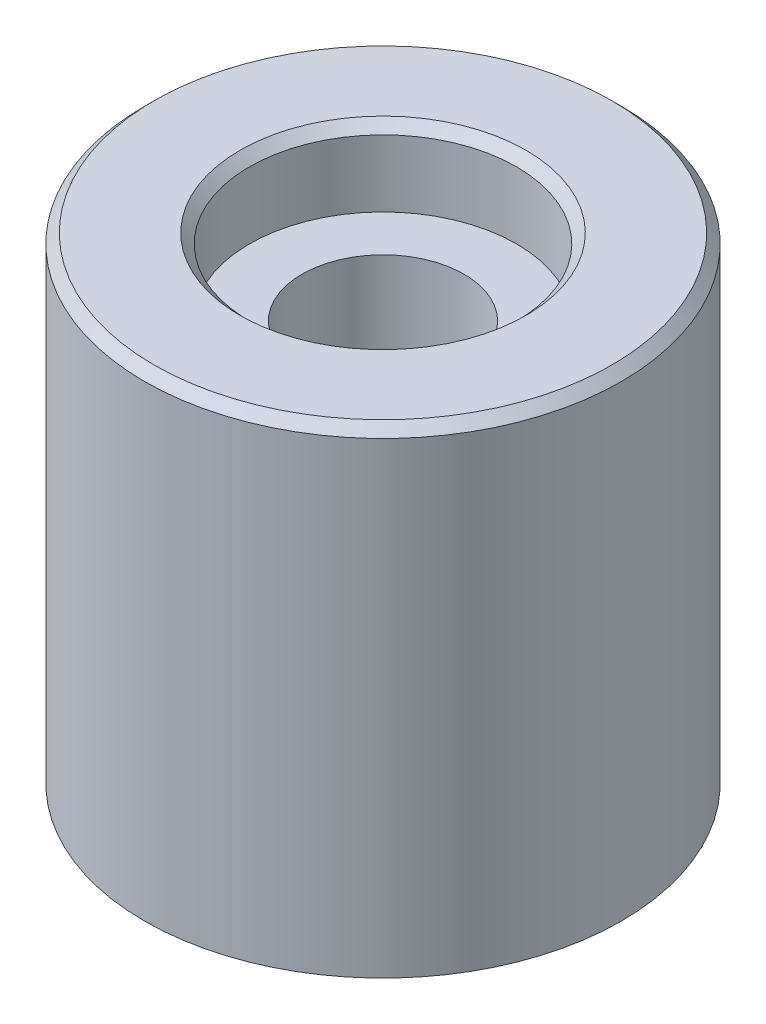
from build123d import *

# Parameters (mm, degrees)
CHANFREIN1_SIZE                               = 0.5
CHANFREIN2_SIZE                               = 0.5
TROU_POUR_TARAUDAGE_POUR_TROU_TARAUD_M1_D     = 8.5
TROU_POUR_TARAUDAGE_POUR_TROU_TARAUD_M1_DEPTH = 18
TROU_POUR_TARAUDAGE_POUR_TROU_TARAUD_M1_TIP   = 2.553657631


with BuildPart() as part:
    # Esquisse1 → R_volution1 (revolve)
    with BuildSketch(Plane.XY, mode=Mode.PRIVATE) as r_volution1_sk:
        Polygon((-7.5, 0), (-7.5, 2), (-12.5, 2), (-12.5, 27), (-7, 27), (-7, 23), (0, 23), (0, 0), align=None)
    revolve(r_volution1_sk.sketch.rotate(Axis((0, 0, 0), (0, 1, 0)), 270), axis=Axis((0, 0, 0), (0, 1, 0)))

    # Chanfrein1
    chanfrein1_edges = [part.edges().sort_by_distance(p)[0] for p in [
        (0, 0, 7.5),
    ]]
    chamfer(chanfrein1_edges, length=CHANFREIN1_SIZE)

    # Chanfrein2
    chanfrein2_edges = [part.edges().sort_by_distance(p)[0] for p in [
        (0, 27, 7),
        (0, 27, 12.5),
    ]]
    chamfer(chanfrein2_edges, length=CHANFREIN2_SIZE)

    # Trou pour taraudage pour trou taraud_ M1
    with Locations(Plane(origin=(0, 23, 0), x_dir=(1, 0, 0), z_dir=(0, 1, 0))):
        with Locations((0, 0)):
            Hole(TROU_POUR_TARAUDAGE_POUR_TROU_TARAUD_M1_D / 2, depth=TROU_POUR_TARAUDAGE_POUR_TROU_TARAUD_M1_DEPTH)
            with Locations((0, 0, -(TROU_POUR_TARAUDAGE_POUR_TROU_TARAUD_M1_DEPTH + TROU_POUR_TARAUDAGE_POUR_TROU_TARAUD_M1_TIP / 2))):  # 118° drill point
                Cone(0, TROU_POUR_TARAUDAGE_POUR_TROU_TARAUD_M1_D / 2, TROU_POUR_TARAUDAGE_POUR_TROU_TARAUD_M1_TIP, mode=Mode.SUBTRACT)


solid = part.part
